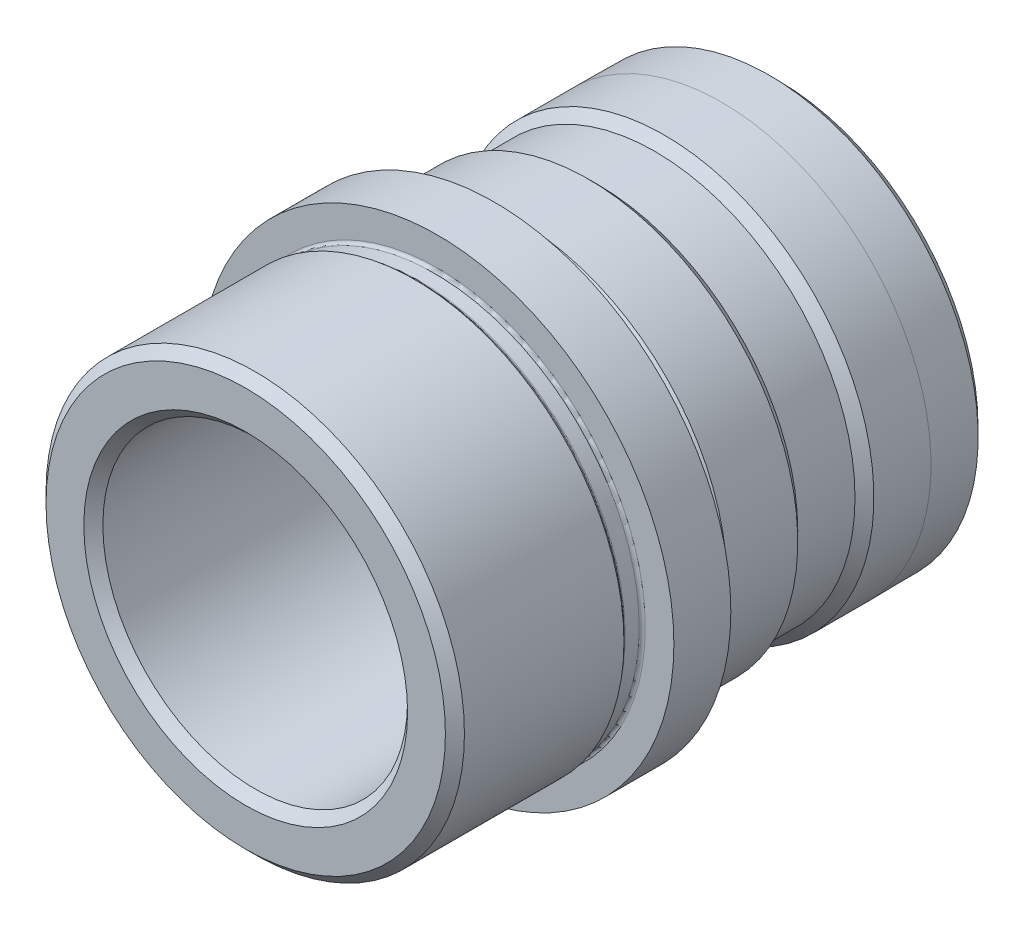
from build123d import *
from OCP.BRepFilletAPI import BRepFilletAPI_MakeChamfer

# Parameters (mm, degrees)
SKETCH2_R          = 2.3749
CUT_EXTRUDE1_DEPTH = 40.828236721
FILLET1_R          = 3.048
CHAMFER1_SIZE      = 0.79375
CHAMFER1_SIZE2     = 0.800768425
FILLET2_R          = 0.254


with BuildPart() as part:
    # Sketch1 → Revolve1 (revolve)
    with BuildSketch(Plane(origin=(0, 0, 0), x_dir=(0, 0, -1), z_dir=(1, 0, 0)), mode=Mode.PRIVATE) as revolve1_sk:
        Polygon((-16.002, 12.70762), (28.448, 12.70762), (28.448, 17.427288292), (23.6855, 17.46885), (18.923, 17.46885), (18.1356, 16.68145), (13.3604, 16.68145), (12.573, 17.46885), (6.67385, 17.46885), (6.2738, 17.0688), (4.7498, 17.0688), (4.7498, 19.7104), (0, 19.7104), (0, 17.0688), (-1.524, 17.0688), (-1.905, 17.4498), (-16.002, 17.4498), align=None)
    revolve(revolve1_sk.sketch.rotate(Axis((0, 0, 0), (0, 0, 1)), 90), axis=Axis((0, 0, 0), (0, 0, 1)))

    # Sketch2 → Cut-Extrude1 (cut, through all)
    with BuildSketch(Plane(origin=(0, 0, 0), x_dir=(1, 0, 0), z_dir=(0, 1, 0))):
        with Locations(Location((0, 15.748, 0), (0, 0, 270))):
            Circle(SKETCH2_R)
    extrude(amount=-CUT_EXTRUDE1_DEPTH, mode=Mode.SUBTRACT)

    # Fillet1
    fillet1_edges = [part.edges().sort_by_distance(p)[0] for p in [
        (12.70762, 0, -28.448),
    ]]
    fillet(fillet1_edges, radius=FILLET1_R)

    # Chamfer1: one chamfer whose edges measure the first distance from different faces: ONE call of the kernel's chamfer builder (chamfer() names one face for all edges)
    chamfer1_edges_1 = [part.edges().sort_by_distance(p)[0] for p in [
        (12.70762, 0, 16.002),
        (17.4498, 0, 16.002),
    ]]
    chamfer1_edges_2 = [part.edges().sort_by_distance(p)[0] for p in [
        (17.427288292, 0, -28.448),
    ]]
    chamfer1_side_2 = [part.faces().sort_by_distance(p)[0] for p in [
        (17.448069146, 0, -26.06675),
    ]]
    chamfer1 = BRepFilletAPI_MakeChamfer(part.part.solid().wrapped)
    for e in chamfer1_edges_1:
        chamfer1.Add(CHAMFER1_SIZE, e.wrapped)
    for e in chamfer1_edges_2:
        chamfer1.Add(CHAMFER1_SIZE, CHAMFER1_SIZE2, e.wrapped, chamfer1_side_2[0].wrapped)  # the first distance lies on this face
    add(Compound.cast(chamfer1.Shape()), mode=Mode.REPLACE)

    # Fillet2
    fillet2_edges = [part.edges().sort_by_distance(p)[0] for p in [
        (17.0688, 0, -6.2738),
        (17.0688, 0, -4.7498),
        (17.0688, 0, 0),
        (17.0688, 0, 1.524),
    ]]
    fillet(fillet2_edges, radius=FILLET2_R)


solid = part.part
